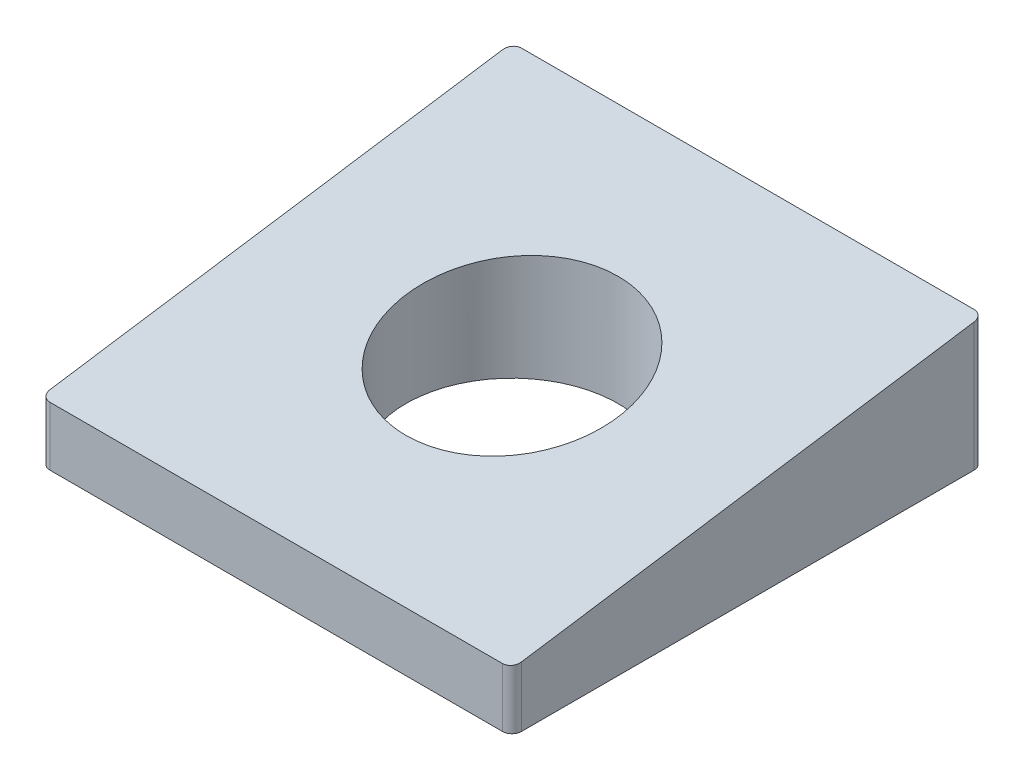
from build123d import *

# Parameters (mm, degrees)
BOSS_EXTRUDE1_DEPTH      = 15.875
BOSS_EXTRUDE1_DEPTH_BACK = 15.875
CUT_EXTRUDE1_DEPTH       = 23.871765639
CUT_EXTRUDE1_DEPTH_BACK  = 23.871765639
SKETCH4_R                = 7.1374
FILLET1_R                = 0.635


with BuildPart() as part:
    # Sketch3 → Boss-Extrude1 (new, two sides: drawn at the far end of the back side and taken through both)
    with BuildSketch(Plane(origin=(0, 0, 0), x_dir=(0, 0, -1), z_dir=(1, 0, 0)).offset(-BOSS_EXTRUDE1_DEPTH_BACK)):
        Polygon((-15.875, -0.4064), (15.875, 4.3688), (15.875, -4.3688), (-15.875, -4.3688), align=None)
    extrude(amount=BOSS_EXTRUDE1_DEPTH + BOSS_EXTRUDE1_DEPTH_BACK)

    # Sketch4 → Cut-Extrude1 (cut, two sides: drawn at the far end of the back side and taken through both)
    with BuildSketch(Plane(origin=(0, 0, 0), x_dir=(1, 0, 0), z_dir=(0, 1, 0)).offset(-CUT_EXTRUDE1_DEPTH_BACK)):
        with Locations(Location((0, 0, 0), (0, 0, 270))):
            Circle(SKETCH4_R)
    extrude(amount=CUT_EXTRUDE1_DEPTH + CUT_EXTRUDE1_DEPTH_BACK, mode=Mode.SUBTRACT)

    # Fillet1
    fillet1_edges = [part.edges().sort_by_distance(p)[0] for p in [
        (-15.875, 0, -15.875),
        (15.875, -2.3876, 15.875),
        (15.875, 0, -15.875),
        (-15.875, -2.3876, 15.875),
    ]]
    fillet(fillet1_edges, radius=FILLET1_R)


solid = part.part
